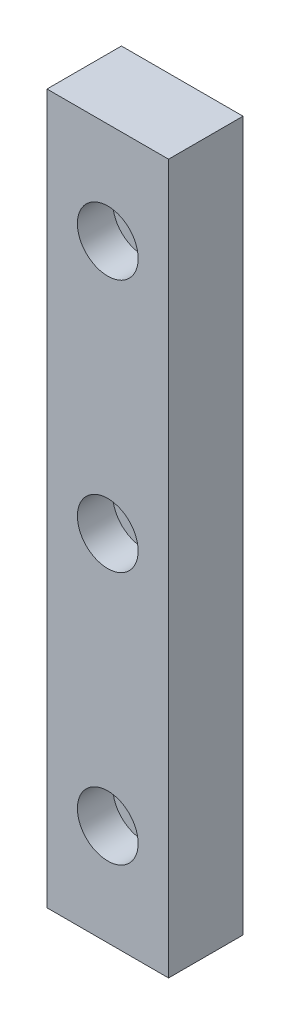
from build123d import *

# Parameters (mm, degrees)
SKETCH_1_W          = 12
SKETCH_1_H          = 70
SKETCH_1_R          = 1.75
EXTRUDE_1_DEPTH     = 7.35
SKETCH_2_R          = 3
CUT_EXTRUDE_1_DEPTH = 3.5


with BuildPart() as part:
    # Sketch 1 → Extrude 1 (new body)
    with BuildSketch(Plane.XY):
        with Locations((6, 35)):
            Rectangle(SKETCH_1_W, SKETCH_1_H)
        with Locations((6, 60)):
            Circle(SKETCH_1_R, mode=Mode.SUBTRACT)
        with Locations((6, 35)):
            Circle(SKETCH_1_R, mode=Mode.SUBTRACT)
        with Locations((6, 10)):
            Circle(SKETCH_1_R, mode=Mode.SUBTRACT)
    extrude(amount=EXTRUDE_1_DEPTH)

    # Sketch 2 → Cut-Extrude 1 (cut)
    with BuildSketch(Plane.XY.offset(7.35)):
        with Locations((6, 60)):
            Circle(SKETCH_2_R)
        with Locations((6, 35)):
            Circle(SKETCH_2_R)
        with Locations((6, 10)):
            Circle(SKETCH_2_R)
    extrude(amount=-CUT_EXTRUDE_1_DEPTH, mode=Mode.SUBTRACT)


solid = part.part
